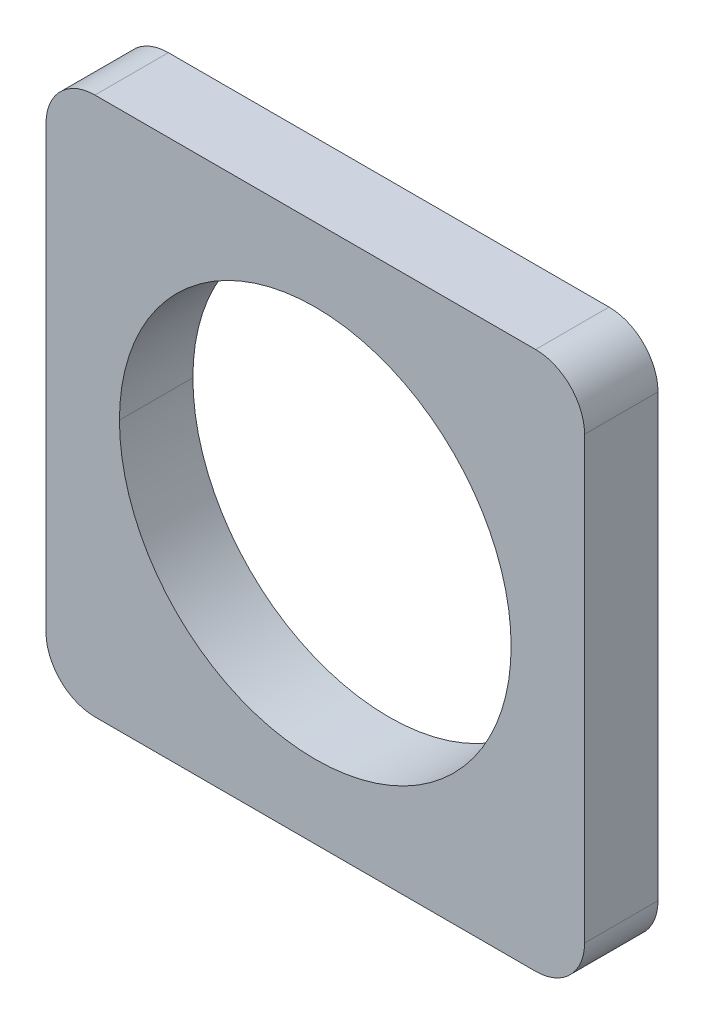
ISO-10303-21;
HEADER;
FILE_DESCRIPTION(('STEP AP214'),'2;1');
FILE_NAME('part.step','',(''),(''),'','','');
FILE_SCHEMA(('AUTOMOTIVE_DESIGN { 1 0 10303 214 1 1 1 1 }'));
ENDSEC;
DATA;
#1=APPLICATION_CONTEXT('core data for automotive mechanical design processes');
#2=APPLICATION_PROTOCOL_DEFINITION('international standard','automotive_design',2000,#1);
#3=PRODUCT_CONTEXT('',#1,'mechanical');
#4=PRODUCT('Part','Part','',(#3));
#5=PRODUCT_RELATED_PRODUCT_CATEGORY('part','',(#4));
#6=PRODUCT_DEFINITION_FORMATION('','',#4);
#7=PRODUCT_DEFINITION_CONTEXT('part definition',#1,'design');
#8=PRODUCT_DEFINITION('design','',#6,#7);
#9=PRODUCT_DEFINITION_SHAPE('','',#8);
#10=(LENGTH_UNIT() NAMED_UNIT(*) SI_UNIT(.MILLI.,.METRE.));
#11=(NAMED_UNIT(*) PLANE_ANGLE_UNIT() SI_UNIT($,.RADIAN.));
#12=(NAMED_UNIT(*) SI_UNIT($,.STERADIAN.) SOLID_ANGLE_UNIT());
#13=UNCERTAINTY_MEASURE_WITH_UNIT(LENGTH_MEASURE(1.E-05),#10,'distance_accuracy_value','');
#14=(GEOMETRIC_REPRESENTATION_CONTEXT(3) GLOBAL_UNCERTAINTY_ASSIGNED_CONTEXT((#13)) GLOBAL_UNIT_ASSIGNED_CONTEXT((#10,
#11,#12)) REPRESENTATION_CONTEXT('',''));
#15=CARTESIAN_POINT('',(0.,0.,0.));
#16=DIRECTION('',(0.,0.,1.));
#17=DIRECTION('',(1.,0.,0.));
#18=AXIS2_PLACEMENT_3D('',#15,#16,#17);
#19=CARTESIAN_POINT('',(-5.5,5.5,0.));
#20=DIRECTION('',(-1.,0.,0.));
#21=DIRECTION('',(0.,0.,1.));
#22=AXIS2_PLACEMENT_3D('',#19,#20,#21);
#23=PLANE('',#22);
#24=DIRECTION('',(0.,-1.,0.));
#25=VECTOR('',#24,1.);
#26=CARTESIAN_POINT('',(-5.5,4.5,0.));
#27=LINE('',#26,#25);
#28=CARTESIAN_POINT('',(-5.5,4.5,0.));
#29=VERTEX_POINT('',#28);
#30=CARTESIAN_POINT('',(-5.5,-4.5,0.));
#31=VERTEX_POINT('',#30);
#32=EDGE_CURVE('E125',#29,#31,#27,.T.);
#33=ORIENTED_EDGE('',*,*,#32,.T.);
#34=DIRECTION('',(0.,0.,-1.));
#35=VECTOR('',#34,1.);
#36=CARTESIAN_POINT('',(-5.5,-4.5,1.5));
#37=LINE('',#36,#35);
#38=CARTESIAN_POINT('',(-5.5,-4.5,1.5));
#39=VERTEX_POINT('',#38);
#40=EDGE_CURVE('E11',#39,#31,#37,.T.);
#41=ORIENTED_EDGE('',*,*,#40,.F.);
#42=DIRECTION('',(0.,-1.,0.));
#43=VECTOR('',#42,1.);
#44=CARTESIAN_POINT('',(-5.5,4.5,1.5));
#45=LINE('',#44,#43);
#46=CARTESIAN_POINT('',(-5.5,4.5,1.5));
#47=VERTEX_POINT('',#46);
#48=EDGE_CURVE('E123',#47,#39,#45,.T.);
#49=ORIENTED_EDGE('',*,*,#48,.F.);
#50=DIRECTION('',(0.,0.,-1.));
#51=VECTOR('',#50,1.);
#52=CARTESIAN_POINT('',(-5.5,4.5,1.5));
#53=LINE('',#52,#51);
#54=EDGE_CURVE('E172',#47,#29,#53,.T.);
#55=ORIENTED_EDGE('',*,*,#54,.T.);
#56=EDGE_LOOP('',(#33,#41,#49,#55));
#57=FACE_BOUND('',#56,.T.);
#58=ADVANCED_FACE('F17',(#57),#23,.T.);
#59=CARTESIAN_POINT('',(-4.5,-4.5,3.4554));
#60=DIRECTION('',(0.,0.,-1.));
#61=DIRECTION('',(0.,-1.,0.));
#62=AXIS2_PLACEMENT_3D('',#59,#60,#61);
#63=CYLINDRICAL_SURFACE('',#62,1.);
#64=DIRECTION('',(0.,0.,-1.));
#65=VECTOR('',#64,1.);
#66=CARTESIAN_POINT('',(-4.5,-5.5,1.5));
#67=LINE('',#66,#65);
#68=CARTESIAN_POINT('',(-4.5,-5.5,1.5));
#69=VERTEX_POINT('',#68);
#70=CARTESIAN_POINT('',(-4.5,-5.5,0.));
#71=VERTEX_POINT('',#70);
#72=EDGE_CURVE('E26',#69,#71,#67,.T.);
#73=ORIENTED_EDGE('',*,*,#72,.F.);
#74=CARTESIAN_POINT('',(-4.5,-4.5,1.5));
#75=DIRECTION('',(0.,0.,1.));
#76=DIRECTION('',(-1.,0.,0.));
#77=AXIS2_PLACEMENT_3D('',#74,#75,#76);
#78=CIRCLE('',#77,1.);
#79=EDGE_CURVE('E130',#39,#69,#78,.T.);
#80=ORIENTED_EDGE('',*,*,#79,.F.);
#81=ORIENTED_EDGE('',*,*,#40,.T.);
#82=CARTESIAN_POINT('',(-4.5,-4.5,0.));
#83=DIRECTION('',(0.,0.,-1.));
#84=DIRECTION('',(0.,-1.,0.));
#85=AXIS2_PLACEMENT_3D('',#82,#83,#84);
#86=CIRCLE('',#85,1.);
#87=EDGE_CURVE('E195',#71,#31,#86,.T.);
#88=ORIENTED_EDGE('',*,*,#87,.F.);
#89=EDGE_LOOP('',(#73,#80,#81,#88));
#90=FACE_BOUND('',#89,.T.);
#91=ADVANCED_FACE('F19',(#90),#63,.T.);
#92=CARTESIAN_POINT('',(-5.5,-5.5,0.));
#93=DIRECTION('',(0.,-1.,0.));
#94=DIRECTION('',(0.,0.,-1.));
#95=AXIS2_PLACEMENT_3D('',#92,#93,#94);
#96=PLANE('',#95);
#97=DIRECTION('',(1.,0.,0.));
#98=VECTOR('',#97,1.);
#99=CARTESIAN_POINT('',(-4.5,-5.5,0.));
#100=LINE('',#99,#98);
#101=CARTESIAN_POINT('',(4.5,-5.5,0.));
#102=VERTEX_POINT('',#101);
#103=EDGE_CURVE('E193',#71,#102,#100,.T.);
#104=ORIENTED_EDGE('',*,*,#103,.T.);
#105=DIRECTION('',(0.,0.,-1.));
#106=VECTOR('',#105,1.);
#107=CARTESIAN_POINT('',(4.5,-5.5,1.5));
#108=LINE('',#107,#106);
#109=CARTESIAN_POINT('',(4.5,-5.5,1.5));
#110=VERTEX_POINT('',#109);
#111=EDGE_CURVE('E185',#110,#102,#108,.T.);
#112=ORIENTED_EDGE('',*,*,#111,.F.);
#113=DIRECTION('',(1.,0.,0.));
#114=VECTOR('',#113,1.);
#115=CARTESIAN_POINT('',(-4.5,-5.5,1.5));
#116=LINE('',#115,#114);
#117=EDGE_CURVE('E135',#69,#110,#116,.T.);
#118=ORIENTED_EDGE('',*,*,#117,.F.);
#119=ORIENTED_EDGE('',*,*,#72,.T.);
#120=EDGE_LOOP('',(#104,#112,#118,#119));
#121=FACE_BOUND('',#120,.T.);
#122=ADVANCED_FACE('F191',(#121),#96,.T.);
#123=CARTESIAN_POINT('',(4.5,-4.5,3.4554));
#124=DIRECTION('',(0.,0.,-1.));
#125=DIRECTION('',(1.,0.,0.));
#126=AXIS2_PLACEMENT_3D('',#123,#124,#125);
#127=CYLINDRICAL_SURFACE('',#126,1.);
#128=DIRECTION('',(0.,0.,-1.));
#129=VECTOR('',#128,1.);
#130=CARTESIAN_POINT('',(5.5,-4.5,1.5));
#131=LINE('',#130,#129);
#132=CARTESIAN_POINT('',(5.5,-4.5,1.5));
#133=VERTEX_POINT('',#132);
#134=CARTESIAN_POINT('',(5.5,-4.5,0.));
#135=VERTEX_POINT('',#134);
#136=EDGE_CURVE('E182',#133,#135,#131,.T.);
#137=ORIENTED_EDGE('',*,*,#136,.F.);
#138=CARTESIAN_POINT('',(4.5,-4.5,1.5));
#139=DIRECTION('',(0.,0.,1.));
#140=DIRECTION('',(0.,-1.,0.));
#141=AXIS2_PLACEMENT_3D('',#138,#139,#140);
#142=CIRCLE('',#141,1.);
#143=EDGE_CURVE('E155',#110,#133,#142,.T.);
#144=ORIENTED_EDGE('',*,*,#143,.F.);
#145=ORIENTED_EDGE('',*,*,#111,.T.);
#146=CARTESIAN_POINT('',(4.5,-4.5,0.));
#147=DIRECTION('',(0.,0.,-1.));
#148=DIRECTION('',(1.,0.,0.));
#149=AXIS2_PLACEMENT_3D('',#146,#147,#148);
#150=CIRCLE('',#149,1.);
#151=EDGE_CURVE('E203',#135,#102,#150,.T.);
#152=ORIENTED_EDGE('',*,*,#151,.F.);
#153=EDGE_LOOP('',(#137,#144,#145,#152));
#154=FACE_BOUND('',#153,.T.);
#155=ADVANCED_FACE('F265',(#154),#127,.T.);
#156=CARTESIAN_POINT('',(5.5,-5.5,0.));
#157=DIRECTION('',(1.,0.,0.));
#158=DIRECTION('',(0.,1.,0.));
#159=AXIS2_PLACEMENT_3D('',#156,#157,#158);
#160=PLANE('',#159);
#161=DIRECTION('',(0.,1.,0.));
#162=VECTOR('',#161,1.);
#163=CARTESIAN_POINT('',(5.5,-4.5,1.5));
#164=LINE('',#163,#162);
#165=CARTESIAN_POINT('',(5.5,4.5,1.5));
#166=VERTEX_POINT('',#165);
#167=EDGE_CURVE('E159',#133,#166,#164,.T.);
#168=ORIENTED_EDGE('',*,*,#167,.F.);
#169=ORIENTED_EDGE('',*,*,#136,.T.);
#170=DIRECTION('',(0.,1.,0.));
#171=VECTOR('',#170,1.);
#172=CARTESIAN_POINT('',(5.5,-4.5,0.));
#173=LINE('',#172,#171);
#174=CARTESIAN_POINT('',(5.5,4.5,0.));
#175=VERTEX_POINT('',#174);
#176=EDGE_CURVE('E208',#135,#175,#173,.T.);
#177=ORIENTED_EDGE('',*,*,#176,.T.);
#178=DIRECTION('',(0.,0.,-1.));
#179=VECTOR('',#178,1.);
#180=CARTESIAN_POINT('',(5.5,4.5,1.5));
#181=LINE('',#180,#179);
#182=EDGE_CURVE('E179',#166,#175,#181,.T.);
#183=ORIENTED_EDGE('',*,*,#182,.F.);
#184=EDGE_LOOP('',(#168,#169,#177,#183));
#185=FACE_BOUND('',#184,.T.);
#186=ADVANCED_FACE('F262',(#185),#160,.T.);
#187=CARTESIAN_POINT('',(4.5,4.5,3.4554));
#188=DIRECTION('',(0.,0.,-1.));
#189=DIRECTION('',(0.,1.,0.));
#190=AXIS2_PLACEMENT_3D('',#187,#188,#189);
#191=CYLINDRICAL_SURFACE('',#190,1.);
#192=DIRECTION('',(0.,0.,-1.));
#193=VECTOR('',#192,1.);
#194=CARTESIAN_POINT('',(4.5,5.5,1.5));
#195=LINE('',#194,#193);
#196=CARTESIAN_POINT('',(4.5,5.5,1.5));
#197=VERTEX_POINT('',#196);
#198=CARTESIAN_POINT('',(4.5,5.5,0.));
#199=VERTEX_POINT('',#198);
#200=EDGE_CURVE('E48',#197,#199,#195,.T.);
#201=ORIENTED_EDGE('',*,*,#200,.F.);
#202=CARTESIAN_POINT('',(4.5,4.5,1.5));
#203=DIRECTION('',(0.,0.,1.));
#204=DIRECTION('',(1.,0.,0.));
#205=AXIS2_PLACEMENT_3D('',#202,#203,#204);
#206=CIRCLE('',#205,1.);
#207=EDGE_CURVE('E163',#166,#197,#206,.T.);
#208=ORIENTED_EDGE('',*,*,#207,.F.);
#209=ORIENTED_EDGE('',*,*,#182,.T.);
#210=CARTESIAN_POINT('',(4.5,4.5,0.));
#211=DIRECTION('',(0.,0.,-1.));
#212=DIRECTION('',(0.,1.,0.));
#213=AXIS2_PLACEMENT_3D('',#210,#211,#212);
#214=CIRCLE('',#213,1.);
#215=EDGE_CURVE('E357',#199,#175,#214,.T.);
#216=ORIENTED_EDGE('',*,*,#215,.F.);
#217=EDGE_LOOP('',(#201,#208,#209,#216));
#218=FACE_BOUND('',#217,.T.);
#219=ADVANCED_FACE('F260',(#218),#191,.T.);
#220=CARTESIAN_POINT('',(5.5,5.5,0.));
#221=DIRECTION('',(0.,1.,0.));
#222=DIRECTION('',(1.,0.,0.));
#223=AXIS2_PLACEMENT_3D('',#220,#221,#222);
#224=PLANE('',#223);
#225=DIRECTION('',(-1.,0.,0.));
#226=VECTOR('',#225,1.);
#227=CARTESIAN_POINT('',(4.5,5.5,1.5));
#228=LINE('',#227,#226);
#229=CARTESIAN_POINT('',(-4.5,5.5,1.5));
#230=VERTEX_POINT('',#229);
#231=EDGE_CURVE('E167',#197,#230,#228,.T.);
#232=ORIENTED_EDGE('',*,*,#231,.F.);
#233=ORIENTED_EDGE('',*,*,#200,.T.);
#234=DIRECTION('',(-1.,0.,0.));
#235=VECTOR('',#234,1.);
#236=CARTESIAN_POINT('',(4.5,5.5,0.));
#237=LINE('',#236,#235);
#238=CARTESIAN_POINT('',(-4.5,5.5,0.));
#239=VERTEX_POINT('',#238);
#240=EDGE_CURVE('E355',#199,#239,#237,.T.);
#241=ORIENTED_EDGE('',*,*,#240,.T.);
#242=DIRECTION('',(0.,0.,-1.));
#243=VECTOR('',#242,1.);
#244=CARTESIAN_POINT('',(-4.5,5.5,1.5));
#245=LINE('',#244,#243);
#246=EDGE_CURVE('E38',#230,#239,#245,.T.);
#247=ORIENTED_EDGE('',*,*,#246,.F.);
#248=EDGE_LOOP('',(#232,#233,#241,#247));
#249=FACE_BOUND('',#248,.T.);
#250=ADVANCED_FACE('F296',(#249),#224,.T.);
#251=CARTESIAN_POINT('',(-4.5,4.5,3.4554));
#252=DIRECTION('',(0.,0.,-1.));
#253=DIRECTION('',(-1.,0.,0.));
#254=AXIS2_PLACEMENT_3D('',#251,#252,#253);
#255=CYLINDRICAL_SURFACE('',#254,1.);
#256=ORIENTED_EDGE('',*,*,#54,.F.);
#257=CARTESIAN_POINT('',(-4.5,4.5,1.5));
#258=DIRECTION('',(0.,0.,1.));
#259=DIRECTION('',(0.,1.,0.));
#260=AXIS2_PLACEMENT_3D('',#257,#258,#259);
#261=CIRCLE('',#260,1.);
#262=EDGE_CURVE('E140',#230,#47,#261,.T.);
#263=ORIENTED_EDGE('',*,*,#262,.F.);
#264=ORIENTED_EDGE('',*,*,#246,.T.);
#265=CARTESIAN_POINT('',(-4.5,4.5,0.));
#266=DIRECTION('',(0.,0.,-1.));
#267=DIRECTION('',(-1.,0.,0.));
#268=AXIS2_PLACEMENT_3D('',#265,#266,#267);
#269=CIRCLE('',#268,1.);
#270=EDGE_CURVE('E214',#29,#239,#269,.T.);
#271=ORIENTED_EDGE('',*,*,#270,.F.);
#272=EDGE_LOOP('',(#256,#263,#264,#271));
#273=FACE_BOUND('',#272,.T.);
#274=ADVANCED_FACE('F303',(#273),#255,.T.);
#275=CARTESIAN_POINT('',(0.,0.,1.5));
#276=DIRECTION('',(0.,0.,1.));
#277=DIRECTION('',(1.,0.,0.));
#278=AXIS2_PLACEMENT_3D('',#275,#276,#277);
#279=PLANE('',#278);
#280=CARTESIAN_POINT('',(0.,0.,1.5));
#281=DIRECTION('',(0.,0.,-1.));
#282=DIRECTION('',(-1.,0.,0.));
#283=AXIS2_PLACEMENT_3D('',#280,#281,#282);
#284=CIRCLE('',#283,4.);
#285=CARTESIAN_POINT('',(-4.,0.,1.5));
#286=VERTEX_POINT('',#285);
#287=CARTESIAN_POINT('',(4.,0.,1.5));
#288=VERTEX_POINT('',#287);
#289=EDGE_CURVE('E142',#286,#288,#284,.T.);
#290=ORIENTED_EDGE('',*,*,#289,.T.);
#291=CARTESIAN_POINT('',(0.,0.,1.5));
#292=DIRECTION('',(0.,0.,-1.));
#293=DIRECTION('',(1.,0.,0.));
#294=AXIS2_PLACEMENT_3D('',#291,#292,#293);
#295=CIRCLE('',#294,4.);
#296=EDGE_CURVE('E150',#288,#286,#295,.T.);
#297=ORIENTED_EDGE('',*,*,#296,.T.);
#298=EDGE_LOOP('',(#290,#297));
#299=FACE_BOUND('',#298,.T.);
#300=ORIENTED_EDGE('',*,*,#48,.T.);
#301=ORIENTED_EDGE('',*,*,#79,.T.);
#302=ORIENTED_EDGE('',*,*,#117,.T.);
#303=ORIENTED_EDGE('',*,*,#143,.T.);
#304=ORIENTED_EDGE('',*,*,#167,.T.);
#305=ORIENTED_EDGE('',*,*,#207,.T.);
#306=ORIENTED_EDGE('',*,*,#231,.T.);
#307=ORIENTED_EDGE('',*,*,#262,.T.);
#308=EDGE_LOOP('',(#300,#301,#302,#303,#304,#305,#306,#307));
#309=FACE_BOUND('',#308,.T.);
#310=ADVANCED_FACE('F138',(#299,#309),#279,.T.);
#311=CARTESIAN_POINT('',(0.,0.,0.));
#312=DIRECTION('',(0.,0.,1.));
#313=DIRECTION('',(1.,0.,0.));
#314=AXIS2_PLACEMENT_3D('',#311,#312,#313);
#315=CYLINDRICAL_SURFACE('',#314,4.);
#316=DIRECTION('',(0.,0.,1.));
#317=VECTOR('',#316,1.);
#318=CARTESIAN_POINT('',(4.,0.,0.));
#319=LINE('',#318,#317);
#320=CARTESIAN_POINT('',(4.,0.,0.));
#321=VERTEX_POINT('',#320);
#322=EDGE_CURVE('E147',#321,#288,#319,.T.);
#323=ORIENTED_EDGE('',*,*,#322,.T.);
#324=ORIENTED_EDGE('',*,*,#289,.F.);
#325=DIRECTION('',(0.,0.,1.));
#326=VECTOR('',#325,1.);
#327=CARTESIAN_POINT('',(-4.,0.,0.));
#328=LINE('',#327,#326);
#329=CARTESIAN_POINT('',(-4.,0.,0.));
#330=VERTEX_POINT('',#329);
#331=EDGE_CURVE('E225',#330,#286,#328,.T.);
#332=ORIENTED_EDGE('',*,*,#331,.F.);
#333=CARTESIAN_POINT('',(0.,0.,0.));
#334=DIRECTION('',(0.,0.,-1.));
#335=DIRECTION('',(-1.,0.,0.));
#336=AXIS2_PLACEMENT_3D('',#333,#334,#335);
#337=CIRCLE('',#336,4.);
#338=EDGE_CURVE('E218',#330,#321,#337,.T.);
#339=ORIENTED_EDGE('',*,*,#338,.T.);
#340=EDGE_LOOP('',(#323,#324,#332,#339));
#341=FACE_BOUND('',#340,.T.);
#342=ADVANCED_FACE('F241',(#341),#315,.F.);
#343=CARTESIAN_POINT('',(0.,0.,0.));
#344=DIRECTION('',(0.,0.,1.));
#345=DIRECTION('',(1.,0.,0.));
#346=AXIS2_PLACEMENT_3D('',#343,#344,#345);
#347=CYLINDRICAL_SURFACE('',#346,4.);
#348=ORIENTED_EDGE('',*,*,#331,.T.);
#349=ORIENTED_EDGE('',*,*,#296,.F.);
#350=ORIENTED_EDGE('',*,*,#322,.F.);
#351=CARTESIAN_POINT('',(0.,0.,0.));
#352=DIRECTION('',(0.,0.,-1.));
#353=DIRECTION('',(1.,0.,0.));
#354=AXIS2_PLACEMENT_3D('',#351,#352,#353);
#355=CIRCLE('',#354,4.);
#356=EDGE_CURVE('E222',#321,#330,#355,.T.);
#357=ORIENTED_EDGE('',*,*,#356,.T.);
#358=EDGE_LOOP('',(#348,#349,#350,#357));
#359=FACE_BOUND('',#358,.T.);
#360=ADVANCED_FACE('F238',(#359),#347,.F.);
#361=CARTESIAN_POINT('',(0.,0.,0.));
#362=DIRECTION('',(0.,0.,1.));
#363=DIRECTION('',(1.,0.,0.));
#364=AXIS2_PLACEMENT_3D('',#361,#362,#363);
#365=PLANE('',#364);
#366=ORIENTED_EDGE('',*,*,#338,.F.);
#367=ORIENTED_EDGE('',*,*,#356,.F.);
#368=EDGE_LOOP('',(#366,#367));
#369=FACE_BOUND('',#368,.T.);
#370=ORIENTED_EDGE('',*,*,#240,.F.);
#371=ORIENTED_EDGE('',*,*,#215,.T.);
#372=ORIENTED_EDGE('',*,*,#176,.F.);
#373=ORIENTED_EDGE('',*,*,#151,.T.);
#374=ORIENTED_EDGE('',*,*,#103,.F.);
#375=ORIENTED_EDGE('',*,*,#87,.T.);
#376=ORIENTED_EDGE('',*,*,#32,.F.);
#377=ORIENTED_EDGE('',*,*,#270,.T.);
#378=EDGE_LOOP('',(#370,#371,#372,#373,#374,#375,#376,#377));
#379=FACE_BOUND('',#378,.T.);
#380=ADVANCED_FACE('F200',(#369,#379),#365,.F.);
#381=CLOSED_SHELL('',(#58,#91,#122,#155,#186,#219,#250,#274,#310,#342,#360,#380));
#382=MANIFOLD_SOLID_BREP('B1',#381);
#383=ADVANCED_BREP_SHAPE_REPRESENTATION('',(#18,#382),#14);
#384=SHAPE_DEFINITION_REPRESENTATION(#9,#383);
ENDSEC;
END-ISO-10303-21;
